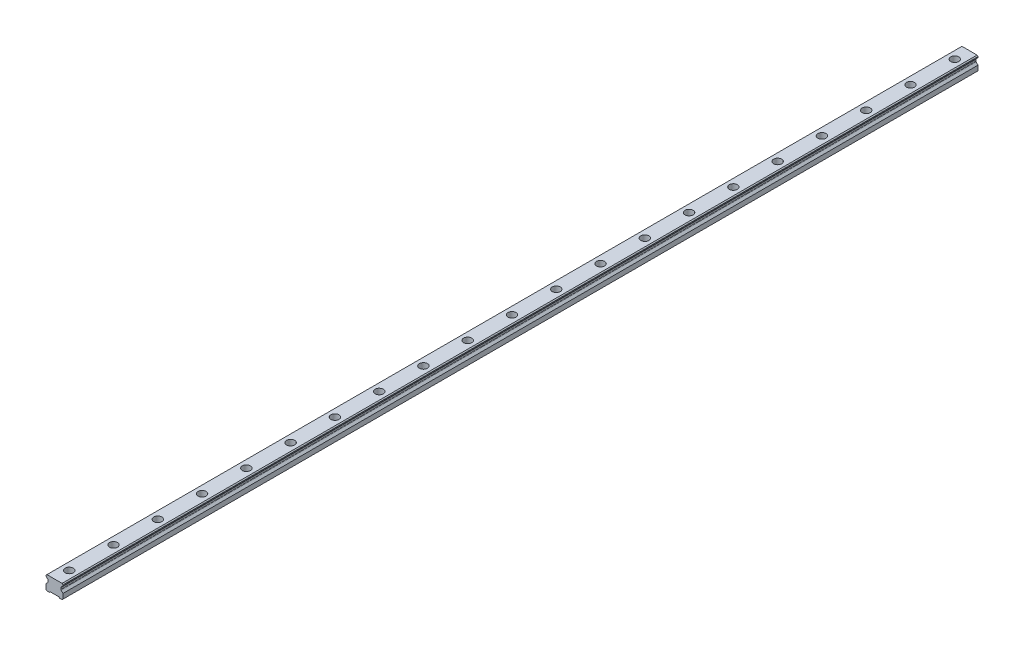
from build123d import *

# Parameters (mm, degrees)
SKETCH1_W           = 23
SKETCH1_H           = 19.2
BOSS_EXTRUDE1_DEPTH = 620
CUT_EXTRUDE1_DEPTH  = 1241.201955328
CHAMFER1_SIZE       = 1.25
FILLET1_R           = 1.25
CUT_EXTRUDE2_DEPTH  = 1241.201955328
SKETCH4_R           = 5.5
SKETCH4_R_2         = 3.5
CUT_EXTRUDE3_DEPTH  = 9
SKETCH4_2_R         = 3.5
CUT_EXTRUDE4_DEPTH  = 621.403812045
LPATTERN1_COUNT     = 21
LPATTERN1_PITCH     = 60


with BuildPart() as part:
    # Sketch1 → Boss-Extrude1 (new, symmetric)
    with BuildSketch(Plane.XY):
        with Locations((0, 9.6)):
            Rectangle(SKETCH1_W, SKETCH1_H)
    extrude(amount=BOSS_EXTRUDE1_DEPTH, both=True)

    # Sketch2 → Cut-Extrude1 (cut, through all)
    with BuildSketch(Plane.XY.offset(620)):
        Polygon((-11.5, 16.7), (-11.5, 7.95), (-8.583333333, 10.866666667), (-8.583333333, 13.783333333), align=None)
        Polygon((8.583333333, 13.783333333), (11.5, 16.7), (11.5, 7.95), (8.583333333, 10.866666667), align=None)
    extrude(amount=-CUT_EXTRUDE1_DEPTH, mode=Mode.SUBTRACT)

    # Chamfer1
    chamfer1_edges = [part.edges().sort_by_distance(p)[0] for p in [
        (-11.5, 19.2, 0),
        (11.5, 19.2, 0),
        (11.5, 0, 0),
        (-11.5, 0, 0),
    ]]
    chamfer(chamfer1_edges, length=CHAMFER1_SIZE)

    # Fillet1
    fillet1_edges = [part.edges().sort_by_distance(p)[0] for p in [
        (-8.583333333, 13.783333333, 0),
        (-8.583333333, 10.866666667, 0),
        (8.583333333, 10.866666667, 0),
        (8.583333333, 13.783333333, 0),
    ]]
    fillet(fillet1_edges, radius=FILLET1_R)

    # Sketch3 → Cut-Extrude2 (cut, through all)
    with BuildSketch(Plane.XY.offset(620)):
        Polygon((-7, 0), (-5.75, 1.25), (5.75, 1.25), (7, 0), align=None)
    extrude(amount=-CUT_EXTRUDE2_DEPTH, mode=Mode.SUBTRACT)

    # Sketch4 → Cut-Extrude3 (cut)
    with BuildSketch(Plane(origin=(0, 19.2, 0), x_dir=(1, 0, 0), z_dir=(0, 1, 0))):
        with Locations(Location((0, -600, 0), (0, 0, 270))):
            Circle(SKETCH4_R)
        with Locations(Location((0, -600, 0), (0, 0, 270))):
            Circle(SKETCH4_R_2, mode=Mode.SUBTRACT)
    cut_extrude3 = extrude(amount=-CUT_EXTRUDE3_DEPTH, mode=Mode.SUBTRACT)

    # Sketch4_2 → Cut-Extrude4 (cut, through all)
    with BuildSketch(Plane(origin=(0, 19.2, 0), x_dir=(1, 0, 0), z_dir=(0, 1, 0))):
        with Locations(Location((0, -600, 0), (0, 0, 270))):
            Circle(SKETCH4_2_R)
    cut_extrude4 = extrude(amount=-CUT_EXTRUDE4_DEPTH, mode=Mode.SUBTRACT)

    # LPattern1: Cut-Extrude3, Cut-Extrude4 ×21
    with Locations(*[(0, 0, -i * LPATTERN1_PITCH) for i in range(1, LPATTERN1_COUNT)]):
        add(cut_extrude3, mode=Mode.SUBTRACT)
        add(cut_extrude4, mode=Mode.SUBTRACT)


solid = part.part
